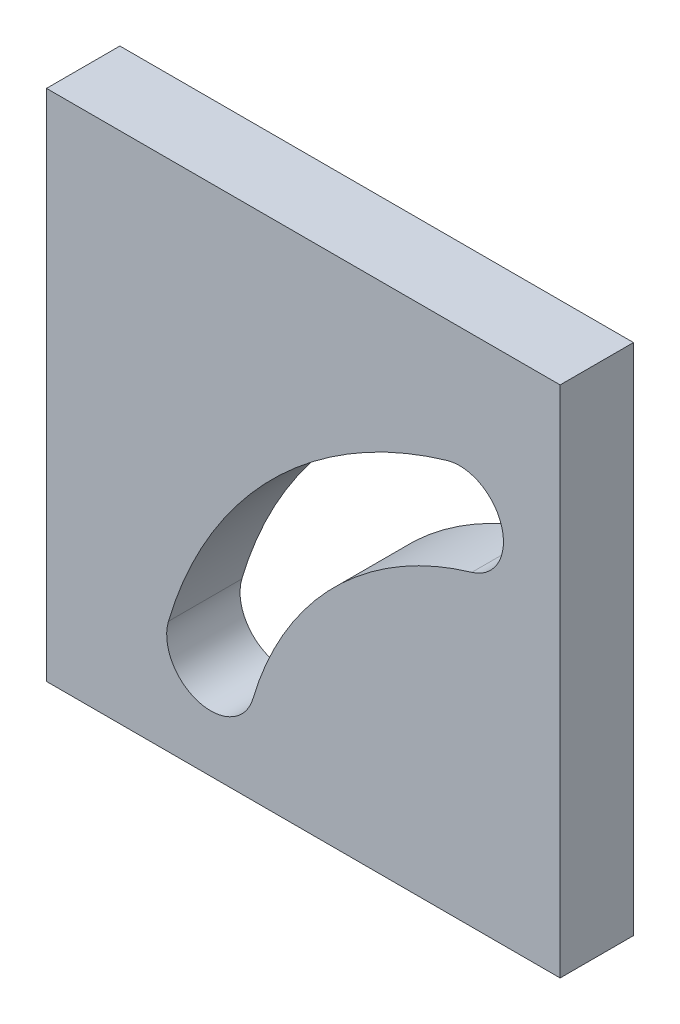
from build123d import *

# Parameters (mm, degrees)
SZKIC1_W                    = 70
SZKIC1_H                    = 70
DODANIE_WYCI_GNI_CIE1_DEPTH = 10


with BuildPart() as part:
    # Szkic1 → Dodanie-wyci_gni_cie1 (new body)
    with BuildSketch(Plane.XY):
        Rectangle(SZKIC1_W, SZKIC1_H)
        with BuildLine():
            ThreePointArc((19.589125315, 18.37944022), (-4.242640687, 4.242640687), (-18.37944022, -19.589125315))
            ThreePointArc((-18.37944022, -19.589125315), (-14.311379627, -27.035660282), (-6.86484466, -22.967599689))
            ThreePointArc((-6.86484466, -22.967599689), (4.242640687, -4.242640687), (22.967599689, 6.86484466))
            ThreePointArc((22.967599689, 6.86484466), (27.035660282, 14.311379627), (19.589125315, 18.37944022))
        make_face(mode=Mode.SUBTRACT)
    extrude(amount=DODANIE_WYCI_GNI_CIE1_DEPTH)


solid = part.part
